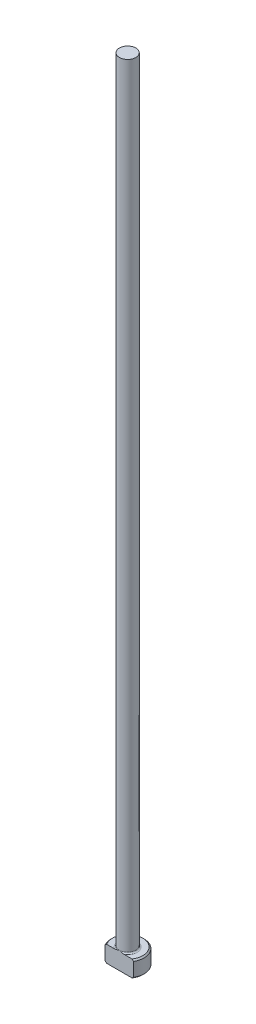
from build123d import *

# Parameters (mm, degrees)
CHAMFER1_SIZE = 0.254
FILLET1_R     = 0.254
KEY_DEPTH     = 153.466131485


with BuildPart() as part:
    # Sketch1 → Revolve1 (revolve)
    with BuildSketch(Plane.XY, mode=Mode.PRIVATE) as revolve1_sk:
        Polygon((0, 0), (-3.175, 0), (-3.175, 3.175), (-1.5875, 3.175), (-1.5875, 152.4), (0, 152.4), align=None)
    revolve(revolve1_sk.sketch.rotate(Axis((0, 259.958771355, 0), (0, -1, 0)), 270), axis=Axis((0, 259.958771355, 0), (0, -1, 0)))

    # Chamfer1
    chamfer1_edges = [part.edges().sort_by_distance(p)[0] for p in [
        (0, 3.175, -3.175),
        (0, 0, -3.175),
    ]]
    chamfer(chamfer1_edges, length=CHAMFER1_SIZE)

    # Fillet1
    fillet1_edges = [part.edges().sort_by_distance(p)[0] for p in [
        (0, 3.175, -1.5875),
    ]]
    fillet(fillet1_edges, radius=FILLET1_R)

    # Sketch2 → Key (cut, through all)
    with BuildSketch(Plane(origin=(0, 0, 0), x_dir=(1, 0, 0), z_dir=(0, 1, 0))):
        with BuildLine():
            Line((-2.749630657, -1.5875), (2.749630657, -1.5875))
            ThreePointArc((2.749630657, -1.5875), (0, -3.175), (-2.749630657, -1.5875))
        make_face()
    extrude(amount=KEY_DEPTH, mode=Mode.SUBTRACT)


solid = part.part
